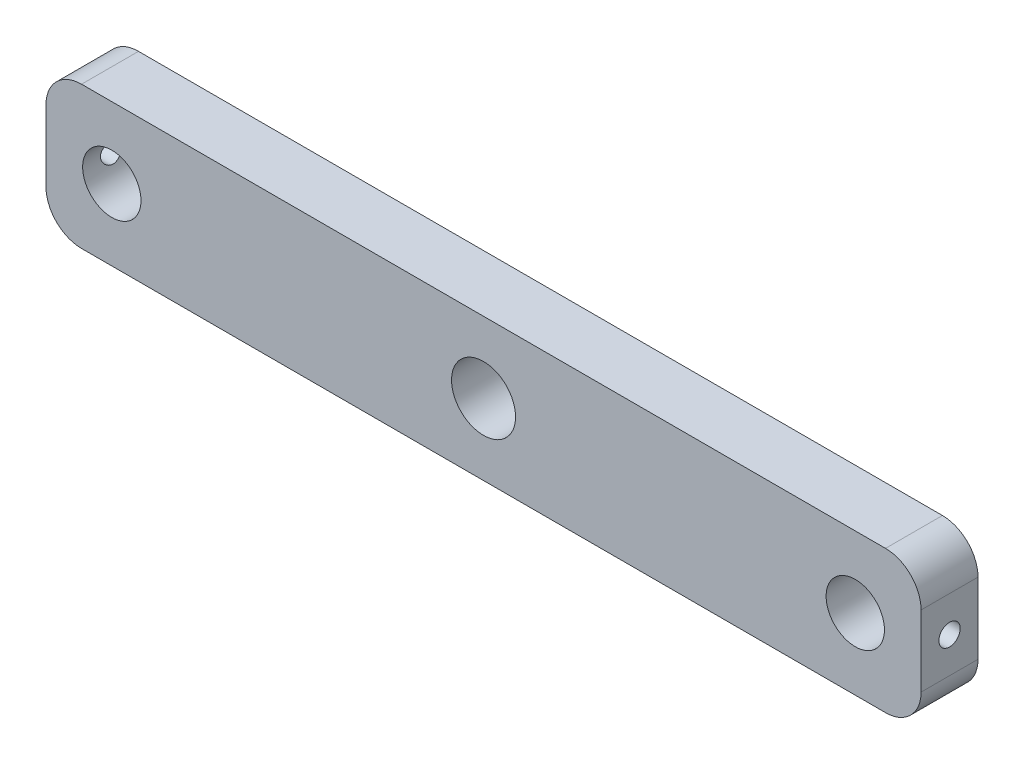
ISO-10303-21;
HEADER;
FILE_DESCRIPTION(('STEP AP214'),'2;1');
FILE_NAME('part.step','',(''),(''),'','','');
FILE_SCHEMA(('AUTOMOTIVE_DESIGN { 1 0 10303 214 1 1 1 1 }'));
ENDSEC;
DATA;
#1=APPLICATION_CONTEXT('core data for automotive mechanical design processes');
#2=APPLICATION_PROTOCOL_DEFINITION('international standard','automotive_design',2000,#1);
#3=PRODUCT_CONTEXT('',#1,'mechanical');
#4=PRODUCT('Part','Part','',(#3));
#5=PRODUCT_RELATED_PRODUCT_CATEGORY('part','',(#4));
#6=PRODUCT_DEFINITION_FORMATION('','',#4);
#7=PRODUCT_DEFINITION_CONTEXT('part definition',#1,'design');
#8=PRODUCT_DEFINITION('design','',#6,#7);
#9=PRODUCT_DEFINITION_SHAPE('','',#8);
#10=(LENGTH_UNIT() NAMED_UNIT(*) SI_UNIT(.MILLI.,.METRE.));
#11=(NAMED_UNIT(*) PLANE_ANGLE_UNIT() SI_UNIT($,.RADIAN.));
#12=(NAMED_UNIT(*) SI_UNIT($,.STERADIAN.) SOLID_ANGLE_UNIT());
#13=UNCERTAINTY_MEASURE_WITH_UNIT(LENGTH_MEASURE(1.E-05),#10,'distance_accuracy_value','');
#14=(GEOMETRIC_REPRESENTATION_CONTEXT(3) GLOBAL_UNCERTAINTY_ASSIGNED_CONTEXT((#13)) GLOBAL_UNIT_ASSIGNED_CONTEXT((#10,
#11,#12)) REPRESENTATION_CONTEXT('',''));
#15=CARTESIAN_POINT('',(0.,0.,0.));
#16=DIRECTION('',(0.,0.,1.));
#17=DIRECTION('',(1.,0.,0.));
#18=AXIS2_PLACEMENT_3D('',#15,#16,#17);
#19=CARTESIAN_POINT('',(0.,0.,8.));
#20=DIRECTION('',(0.,0.,1.));
#21=DIRECTION('',(1.,0.,0.));
#22=AXIS2_PLACEMENT_3D('',#19,#20,#21);
#23=PLANE('',#22);
#24=CARTESIAN_POINT('',(-61.5,9.99999999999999,8.));
#25=DIRECTION('',(0.,0.,1.));
#26=DIRECTION('',(1.,0.,0.));
#27=AXIS2_PLACEMENT_3D('',#24,#25,#26);
#28=CIRCLE('',#27,4.5);
#29=CARTESIAN_POINT('',(-57.,9.99999999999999,8.));
#30=VERTEX_POINT('',#29);
#31=EDGE_CURVE('E187',#30,#30,#28,.T.);
#32=ORIENTED_EDGE('',*,*,#31,.F.);
#33=EDGE_LOOP('',(#32));
#34=FACE_BOUND('',#33,.T.);
#35=DIRECTION('',(0.,1.,0.));
#36=VECTOR('',#35,1.);
#37=CARTESIAN_POINT('',(0.,0.,8.));
#38=LINE('',#37,#36);
#39=CARTESIAN_POINT('',(0.,5.,8.));
#40=VERTEX_POINT('',#39);
#41=CARTESIAN_POINT('',(0.,15.,8.));
#42=VERTEX_POINT('',#41);
#43=EDGE_CURVE('E130',#40,#42,#38,.T.);
#44=ORIENTED_EDGE('',*,*,#43,.T.);
#45=CARTESIAN_POINT('',(-5.,15.,8.));
#46=DIRECTION('',(0.,0.,1.));
#47=DIRECTION('',(1.,0.,0.));
#48=AXIS2_PLACEMENT_3D('',#45,#46,#47);
#49=CIRCLE('',#48,5.);
#50=CARTESIAN_POINT('',(-5.,20.,8.));
#51=VERTEX_POINT('',#50);
#52=EDGE_CURVE('E155',#42,#51,#49,.T.);
#53=ORIENTED_EDGE('',*,*,#52,.T.);
#54=DIRECTION('',(-1.,0.,0.));
#55=VECTOR('',#54,1.);
#56=CARTESIAN_POINT('',(0.,20.,8.));
#57=LINE('',#56,#55);
#58=CARTESIAN_POINT('',(-118.,20.,8.));
#59=VERTEX_POINT('',#58);
#60=EDGE_CURVE('E174',#51,#59,#57,.T.);
#61=ORIENTED_EDGE('',*,*,#60,.T.);
#62=CARTESIAN_POINT('',(-118.,15.,8.));
#63=DIRECTION('',(0.,0.,1.));
#64=DIRECTION('',(1.,0.,0.));
#65=AXIS2_PLACEMENT_3D('',#62,#63,#64);
#66=CIRCLE('',#65,5.);
#67=CARTESIAN_POINT('',(-123.,15.,8.));
#68=VERTEX_POINT('',#67);
#69=EDGE_CURVE('E137',#59,#68,#66,.T.);
#70=ORIENTED_EDGE('',*,*,#69,.T.);
#71=DIRECTION('',(0.,-1.,0.));
#72=VECTOR('',#71,1.);
#73=CARTESIAN_POINT('',(-123.,0.,8.));
#74=LINE('',#73,#72);
#75=CARTESIAN_POINT('',(-123.,4.99999999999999,8.));
#76=VERTEX_POINT('',#75);
#77=EDGE_CURVE('E120',#68,#76,#74,.T.);
#78=ORIENTED_EDGE('',*,*,#77,.T.);
#79=CARTESIAN_POINT('',(-118.,4.99999999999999,8.));
#80=DIRECTION('',(0.,0.,1.));
#81=DIRECTION('',(1.,0.,0.));
#82=AXIS2_PLACEMENT_3D('',#79,#80,#81);
#83=CIRCLE('',#82,5.);
#84=CARTESIAN_POINT('',(-118.,0.,8.));
#85=VERTEX_POINT('',#84);
#86=EDGE_CURVE('E58',#76,#85,#83,.T.);
#87=ORIENTED_EDGE('',*,*,#86,.T.);
#88=DIRECTION('',(1.,0.,0.));
#89=VECTOR('',#88,1.);
#90=CARTESIAN_POINT('',(0.,0.,8.));
#91=LINE('',#90,#89);
#92=CARTESIAN_POINT('',(-5.,0.,8.));
#93=VERTEX_POINT('',#92);
#94=EDGE_CURVE('E121',#85,#93,#91,.T.);
#95=ORIENTED_EDGE('',*,*,#94,.T.);
#96=CARTESIAN_POINT('',(-5.,5.,8.));
#97=DIRECTION('',(0.,0.,1.));
#98=DIRECTION('',(1.,0.,0.));
#99=AXIS2_PLACEMENT_3D('',#96,#97,#98);
#100=CIRCLE('',#99,5.);
#101=EDGE_CURVE('E153',#93,#40,#100,.T.);
#102=ORIENTED_EDGE('',*,*,#101,.T.);
#103=EDGE_LOOP('',(#44,#53,#61,#70,#78,#87,#95,#102));
#104=FACE_BOUND('',#103,.T.);
#105=CARTESIAN_POINT('',(-113.75,9.99999999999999,8.));
#106=DIRECTION('',(0.,0.,1.));
#107=DIRECTION('',(1.,0.,0.));
#108=AXIS2_PLACEMENT_3D('',#105,#106,#107);
#109=CIRCLE('',#108,4.09999999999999);
#110=CARTESIAN_POINT('',(-109.65,9.99999999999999,8.));
#111=VERTEX_POINT('',#110);
#112=EDGE_CURVE('E182',#111,#111,#109,.T.);
#113=ORIENTED_EDGE('',*,*,#112,.F.);
#114=EDGE_LOOP('',(#113));
#115=FACE_BOUND('',#114,.T.);
#116=CARTESIAN_POINT('',(-9.25,9.99999999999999,8.));
#117=DIRECTION('',(0.,0.,1.));
#118=DIRECTION('',(1.,0.,0.));
#119=AXIS2_PLACEMENT_3D('',#116,#117,#118);
#120=CIRCLE('',#119,4.1);
#121=CARTESIAN_POINT('',(-5.15,9.99999999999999,8.));
#122=VERTEX_POINT('',#121);
#123=EDGE_CURVE('E192',#122,#122,#120,.T.);
#124=ORIENTED_EDGE('',*,*,#123,.F.);
#125=EDGE_LOOP('',(#124));
#126=FACE_BOUND('',#125,.T.);
#127=ADVANCED_FACE('F37',(#34,#104,#115,#126),#23,.T.);
#128=CARTESIAN_POINT('',(0.,0.,0.));
#129=DIRECTION('',(0.,0.,1.));
#130=DIRECTION('',(1.,0.,0.));
#131=AXIS2_PLACEMENT_3D('',#128,#129,#130);
#132=PLANE('',#131);
#133=DIRECTION('',(-1.,0.,0.));
#134=VECTOR('',#133,1.);
#135=CARTESIAN_POINT('',(0.,20.,0.));
#136=LINE('',#135,#134);
#137=CARTESIAN_POINT('',(-5.,20.,0.));
#138=VERTEX_POINT('',#137);
#139=CARTESIAN_POINT('',(-118.,20.,0.));
#140=VERTEX_POINT('',#139);
#141=EDGE_CURVE('E128',#138,#140,#136,.T.);
#142=ORIENTED_EDGE('',*,*,#141,.F.);
#143=CARTESIAN_POINT('',(-5.,15.,0.));
#144=DIRECTION('',(0.,0.,1.));
#145=DIRECTION('',(1.,0.,0.));
#146=AXIS2_PLACEMENT_3D('',#143,#144,#145);
#147=CIRCLE('',#146,5.);
#148=CARTESIAN_POINT('',(0.,15.,0.));
#149=VERTEX_POINT('',#148);
#150=EDGE_CURVE('E145',#138,#149,#147,.F.);
#151=ORIENTED_EDGE('',*,*,#150,.T.);
#152=DIRECTION('',(0.,1.,0.));
#153=VECTOR('',#152,1.);
#154=CARTESIAN_POINT('',(0.,0.,0.));
#155=LINE('',#154,#153);
#156=CARTESIAN_POINT('',(0.,5.,0.));
#157=VERTEX_POINT('',#156);
#158=EDGE_CURVE('E132',#157,#149,#155,.T.);
#159=ORIENTED_EDGE('',*,*,#158,.F.);
#160=CARTESIAN_POINT('',(-5.,5.,0.));
#161=DIRECTION('',(0.,0.,1.));
#162=DIRECTION('',(1.,0.,0.));
#163=AXIS2_PLACEMENT_3D('',#160,#161,#162);
#164=CIRCLE('',#163,5.);
#165=CARTESIAN_POINT('',(-5.,0.,0.));
#166=VERTEX_POINT('',#165);
#167=EDGE_CURVE('E143',#157,#166,#164,.F.);
#168=ORIENTED_EDGE('',*,*,#167,.T.);
#169=DIRECTION('',(1.,0.,0.));
#170=VECTOR('',#169,1.);
#171=CARTESIAN_POINT('',(0.,0.,0.));
#172=LINE('',#171,#170);
#173=CARTESIAN_POINT('',(-118.,0.,0.));
#174=VERTEX_POINT('',#173);
#175=EDGE_CURVE('E127',#174,#166,#172,.T.);
#176=ORIENTED_EDGE('',*,*,#175,.F.);
#177=CARTESIAN_POINT('',(-118.,4.99999999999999,0.));
#178=DIRECTION('',(0.,0.,1.));
#179=DIRECTION('',(1.,0.,0.));
#180=AXIS2_PLACEMENT_3D('',#177,#178,#179);
#181=CIRCLE('',#180,5.);
#182=CARTESIAN_POINT('',(-123.,4.99999999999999,0.));
#183=VERTEX_POINT('',#182);
#184=EDGE_CURVE('E126',#174,#183,#181,.F.);
#185=ORIENTED_EDGE('',*,*,#184,.T.);
#186=DIRECTION('',(0.,-1.,0.));
#187=VECTOR('',#186,1.);
#188=CARTESIAN_POINT('',(-123.,0.,0.));
#189=LINE('',#188,#187);
#190=CARTESIAN_POINT('',(-123.,15.,0.));
#191=VERTEX_POINT('',#190);
#192=EDGE_CURVE('E118',#191,#183,#189,.T.);
#193=ORIENTED_EDGE('',*,*,#192,.F.);
#194=CARTESIAN_POINT('',(-118.,15.,0.));
#195=DIRECTION('',(0.,0.,1.));
#196=DIRECTION('',(1.,0.,0.));
#197=AXIS2_PLACEMENT_3D('',#194,#195,#196);
#198=CIRCLE('',#197,5.);
#199=EDGE_CURVE('E103',#191,#140,#198,.F.);
#200=ORIENTED_EDGE('',*,*,#199,.T.);
#201=EDGE_LOOP('',(#142,#151,#159,#168,#176,#185,#193,#200));
#202=FACE_BOUND('',#201,.T.);
#203=CARTESIAN_POINT('',(-113.75,9.99999999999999,0.));
#204=DIRECTION('',(0.,0.,1.));
#205=DIRECTION('',(1.,0.,0.));
#206=AXIS2_PLACEMENT_3D('',#203,#204,#205);
#207=CIRCLE('',#206,4.09999999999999);
#208=CARTESIAN_POINT('',(-109.65,9.99999999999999,0.));
#209=VERTEX_POINT('',#208);
#210=EDGE_CURVE('E178',#209,#209,#207,.T.);
#211=ORIENTED_EDGE('',*,*,#210,.T.);
#212=EDGE_LOOP('',(#211));
#213=FACE_BOUND('',#212,.T.);
#214=CARTESIAN_POINT('',(-61.5,9.99999999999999,0.));
#215=DIRECTION('',(0.,0.,1.));
#216=DIRECTION('',(1.,0.,0.));
#217=AXIS2_PLACEMENT_3D('',#214,#215,#216);
#218=CIRCLE('',#217,4.5);
#219=CARTESIAN_POINT('',(-57.,9.99999999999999,0.));
#220=VERTEX_POINT('',#219);
#221=EDGE_CURVE('E189',#220,#220,#218,.T.);
#222=ORIENTED_EDGE('',*,*,#221,.T.);
#223=EDGE_LOOP('',(#222));
#224=FACE_BOUND('',#223,.T.);
#225=CARTESIAN_POINT('',(-9.25,9.99999999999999,0.));
#226=DIRECTION('',(0.,0.,1.));
#227=DIRECTION('',(1.,0.,0.));
#228=AXIS2_PLACEMENT_3D('',#225,#226,#227);
#229=CIRCLE('',#228,4.1);
#230=CARTESIAN_POINT('',(-5.15,9.99999999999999,0.));
#231=VERTEX_POINT('',#230);
#232=EDGE_CURVE('E195',#231,#231,#229,.T.);
#233=ORIENTED_EDGE('',*,*,#232,.T.);
#234=EDGE_LOOP('',(#233));
#235=FACE_BOUND('',#234,.T.);
#236=ADVANCED_FACE('F123',(#202,#213,#224,#235),#132,.F.);
#237=CARTESIAN_POINT('',(0.,0.,8.));
#238=DIRECTION('',(-1.,0.,0.));
#239=DIRECTION('',(0.,0.,1.));
#240=AXIS2_PLACEMENT_3D('',#237,#238,#239);
#241=PLANE('',#240);
#242=CARTESIAN_POINT('',(0.,10.,4.));
#243=DIRECTION('',(1.,0.,0.));
#244=DIRECTION('',(0.,0.,-1.));
#245=AXIS2_PLACEMENT_3D('',#242,#243,#244);
#246=CIRCLE('',#245,1.5);
#247=CARTESIAN_POINT('',(0.,10.,2.5));
#248=VERTEX_POINT('',#247);
#249=EDGE_CURVE('E212',#248,#248,#246,.T.);
#250=ORIENTED_EDGE('',*,*,#249,.F.);
#251=EDGE_LOOP('',(#250));
#252=FACE_BOUND('',#251,.T.);
#253=ORIENTED_EDGE('',*,*,#158,.T.);
#254=DIRECTION('',(0.,0.,-1.));
#255=VECTOR('',#254,1.);
#256=CARTESIAN_POINT('',(0.,15.,8.));
#257=LINE('',#256,#255);
#258=EDGE_CURVE('E150',#149,#42,#257,.F.);
#259=ORIENTED_EDGE('',*,*,#258,.T.);
#260=ORIENTED_EDGE('',*,*,#43,.F.);
#261=DIRECTION('',(0.,0.,-1.));
#262=VECTOR('',#261,1.);
#263=CARTESIAN_POINT('',(0.,5.,8.));
#264=LINE('',#263,#262);
#265=EDGE_CURVE('E147',#40,#157,#264,.T.);
#266=ORIENTED_EDGE('',*,*,#265,.T.);
#267=EDGE_LOOP('',(#253,#259,#260,#266));
#268=FACE_BOUND('',#267,.T.);
#269=ADVANCED_FACE('F170',(#252,#268),#241,.F.);
#270=CARTESIAN_POINT('',(0.,20.,8.));
#271=DIRECTION('',(0.,-1.,0.));
#272=DIRECTION('',(1.,0.,0.));
#273=AXIS2_PLACEMENT_3D('',#270,#271,#272);
#274=PLANE('',#273);
#275=ORIENTED_EDGE('',*,*,#60,.F.);
#276=DIRECTION('',(0.,0.,-1.));
#277=VECTOR('',#276,1.);
#278=CARTESIAN_POINT('',(-5.,20.,8.));
#279=LINE('',#278,#277);
#280=EDGE_CURVE('E139',#51,#138,#279,.T.);
#281=ORIENTED_EDGE('',*,*,#280,.T.);
#282=ORIENTED_EDGE('',*,*,#141,.T.);
#283=DIRECTION('',(0.,0.,-1.));
#284=VECTOR('',#283,1.);
#285=CARTESIAN_POINT('',(-118.,20.,8.));
#286=LINE('',#285,#284);
#287=EDGE_CURVE('E109',#140,#59,#286,.F.);
#288=ORIENTED_EDGE('',*,*,#287,.T.);
#289=EDGE_LOOP('',(#275,#281,#282,#288));
#290=FACE_BOUND('',#289,.T.);
#291=ADVANCED_FACE('F234',(#290),#274,.F.);
#292=CARTESIAN_POINT('',(-123.,0.,8.));
#293=DIRECTION('',(1.,0.,0.));
#294=DIRECTION('',(0.,0.,-1.));
#295=AXIS2_PLACEMENT_3D('',#292,#293,#294);
#296=PLANE('',#295);
#297=CARTESIAN_POINT('',(-123.,9.99999999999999,4.));
#298=DIRECTION('',(-1.,0.,0.));
#299=DIRECTION('',(0.,0.,1.));
#300=AXIS2_PLACEMENT_3D('',#297,#298,#299);
#301=CIRCLE('',#300,1.5);
#302=CARTESIAN_POINT('',(-123.,9.99999999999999,5.5));
#303=VERTEX_POINT('',#302);
#304=EDGE_CURVE('E198',#303,#303,#301,.T.);
#305=ORIENTED_EDGE('',*,*,#304,.F.);
#306=EDGE_LOOP('',(#305));
#307=FACE_BOUND('',#306,.T.);
#308=ORIENTED_EDGE('',*,*,#192,.T.);
#309=DIRECTION('',(0.,0.,-1.));
#310=VECTOR('',#309,1.);
#311=CARTESIAN_POINT('',(-123.,4.99999999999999,8.));
#312=LINE('',#311,#310);
#313=EDGE_CURVE('E11',#183,#76,#312,.F.);
#314=ORIENTED_EDGE('',*,*,#313,.T.);
#315=ORIENTED_EDGE('',*,*,#77,.F.);
#316=DIRECTION('',(0.,0.,-1.));
#317=VECTOR('',#316,1.);
#318=CARTESIAN_POINT('',(-123.,15.,8.));
#319=LINE('',#318,#317);
#320=EDGE_CURVE('E107',#68,#191,#319,.T.);
#321=ORIENTED_EDGE('',*,*,#320,.T.);
#322=EDGE_LOOP('',(#308,#314,#315,#321));
#323=FACE_BOUND('',#322,.T.);
#324=ADVANCED_FACE('F117',(#307,#323),#296,.F.);
#325=CARTESIAN_POINT('',(0.,0.,8.));
#326=DIRECTION('',(0.,1.,0.));
#327=DIRECTION('',(-1.,0.,0.));
#328=AXIS2_PLACEMENT_3D('',#325,#326,#327);
#329=PLANE('',#328);
#330=ORIENTED_EDGE('',*,*,#175,.T.);
#331=DIRECTION('',(0.,0.,-1.));
#332=VECTOR('',#331,1.);
#333=CARTESIAN_POINT('',(-5.,0.,8.));
#334=LINE('',#333,#332);
#335=EDGE_CURVE('E45',#166,#93,#334,.F.);
#336=ORIENTED_EDGE('',*,*,#335,.T.);
#337=ORIENTED_EDGE('',*,*,#94,.F.);
#338=DIRECTION('',(0.,0.,-1.));
#339=VECTOR('',#338,1.);
#340=CARTESIAN_POINT('',(-118.,0.,8.));
#341=LINE('',#340,#339);
#342=EDGE_CURVE('E157',#85,#174,#341,.T.);
#343=ORIENTED_EDGE('',*,*,#342,.T.);
#344=EDGE_LOOP('',(#330,#336,#337,#343));
#345=FACE_BOUND('',#344,.T.);
#346=ADVANCED_FACE('F160',(#345),#329,.F.);
#347=CARTESIAN_POINT('',(-113.75,9.99999999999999,8.));
#348=DIRECTION('',(0.,0.,-1.));
#349=DIRECTION('',(-1.,0.,0.));
#350=AXIS2_PLACEMENT_3D('',#347,#348,#349);
#351=CYLINDRICAL_SURFACE('',#350,4.09999999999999);
#352=CARTESIAN_POINT('',(-117.85,9.99999999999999,5.5));
#353=CARTESIAN_POINT('',(-117.850001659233,10.0813740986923,5.50000225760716));
#354=CARTESIAN_POINT('',(-117.847556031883,10.1627323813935,5.49335733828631));
#355=CARTESIAN_POINT('',(-117.838043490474,10.3230252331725,5.46705471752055));
#356=CARTESIAN_POINT('',(-117.830976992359,10.4019600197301,5.44739818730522));
#357=CARTESIAN_POINT('',(-117.812983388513,10.5550714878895,5.39585535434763));
#358=CARTESIAN_POINT('',(-117.802063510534,10.6292567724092,5.36399193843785));
#359=CARTESIAN_POINT('',(-117.777456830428,10.7712256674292,5.28905328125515));
#360=CARTESIAN_POINT('',(-117.763769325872,10.8390076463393,5.24597519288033));
#361=CARTESIAN_POINT('',(-117.734423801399,10.9690058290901,5.14799554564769));
#362=CARTESIAN_POINT('',(-117.718711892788,11.0309264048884,5.09271802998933));
#363=CARTESIAN_POINT('',(-117.687360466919,11.1448538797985,4.97270690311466));
#364=CARTESIAN_POINT('',(-117.67172097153,11.196857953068,4.9079706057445));
#365=CARTESIAN_POINT('',(-117.641666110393,11.2913112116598,4.76804336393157));
#366=CARTESIAN_POINT('',(-117.627314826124,11.333350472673,4.69256058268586));
#367=CARTESIAN_POINT('',(-117.602295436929,11.4040068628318,4.53498771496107));
#368=CARTESIAN_POINT('',(-117.591625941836,11.4326290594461,4.45290013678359));
#369=CARTESIAN_POINT('',(-117.575752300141,11.4744848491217,4.28784309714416));
#370=CARTESIAN_POINT('',(-117.570349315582,11.4882805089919,4.20503591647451));
#371=CARTESIAN_POINT('',(-117.565037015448,11.5018491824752,4.03811924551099));
#372=CARTESIAN_POINT('',(-117.565125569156,11.5016276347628,3.95401027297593));
#373=CARTESIAN_POINT('',(-117.570614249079,11.4875994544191,3.79193635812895));
#374=CARTESIAN_POINT('',(-117.575713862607,11.4745614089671,3.71389285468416));
#375=CARTESIAN_POINT('',(-117.590152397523,11.4365370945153,3.56118956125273));
#376=CARTESIAN_POINT('',(-117.599491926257,11.4115491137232,3.48653025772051));
#377=CARTESIAN_POINT('',(-117.621546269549,11.3498942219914,3.34110766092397));
#378=CARTESIAN_POINT('',(-117.634319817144,11.3130216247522,3.27044087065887));
#379=CARTESIAN_POINT('',(-117.661782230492,11.2287873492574,3.13607014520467));
#380=CARTESIAN_POINT('',(-117.676471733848,11.1814221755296,3.07236854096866));
#381=CARTESIAN_POINT('',(-117.707253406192,11.0739910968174,2.94946662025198));
#382=CARTESIAN_POINT('',(-117.723375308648,11.0133081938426,2.89081180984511));
#383=CARTESIAN_POINT('',(-117.754397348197,10.8827781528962,2.7843534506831));
#384=CARTESIAN_POINT('',(-117.769297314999,10.8129297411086,2.73655141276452));
#385=CARTESIAN_POINT('',(-117.796467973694,10.6647140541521,2.65259238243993));
#386=CARTESIAN_POINT('',(-117.808698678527,10.5862406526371,2.61660888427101));
#387=CARTESIAN_POINT('',(-117.82885780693,10.4237962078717,2.55853261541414));
#388=CARTESIAN_POINT('',(-117.836788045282,10.3398275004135,2.536433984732));
#389=CARTESIAN_POINT('',(-117.847137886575,10.1733733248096,2.50778451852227));
#390=CARTESIAN_POINT('',(-117.849817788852,10.0910304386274,2.50049855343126));
#391=CARTESIAN_POINT('',(-117.850163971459,9.92626501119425,2.49955130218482));
#392=CARTESIAN_POINT('',(-117.847831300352,9.84384249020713,2.50588716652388));
#393=CARTESIAN_POINT('',(-117.838586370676,9.68438031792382,2.5314392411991));
#394=CARTESIAN_POINT('',(-117.831842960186,9.60725381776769,2.55018085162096));
#395=CARTESIAN_POINT('',(-117.814623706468,9.45728861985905,2.59939476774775));
#396=CARTESIAN_POINT('',(-117.804147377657,9.38445048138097,2.6298685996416));
#397=CARTESIAN_POINT('',(-117.7801281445,9.24278090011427,2.70263978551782));
#398=CARTESIAN_POINT('',(-117.76650558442,9.17412535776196,2.74525249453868));
#399=CARTESIAN_POINT('',(-117.737710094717,9.04471452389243,2.8407324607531));
#400=CARTESIAN_POINT('',(-117.722536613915,8.98396205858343,2.8936033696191));
#401=CARTESIAN_POINT('',(-117.691276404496,8.86858034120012,3.01153499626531));
#402=CARTESIAN_POINT('',(-117.675185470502,8.81447372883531,3.07710725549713));
#403=CARTESIAN_POINT('',(-117.644725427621,8.71793766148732,3.21672556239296));
#404=CARTESIAN_POINT('',(-117.630356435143,8.67550899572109,3.29077218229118));
#405=CARTESIAN_POINT('',(-117.605050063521,8.60355617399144,3.44569559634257));
#406=CARTESIAN_POINT('',(-117.59412129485,8.57406432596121,3.52658889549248));
#407=CARTESIAN_POINT('',(-117.577222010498,8.52930109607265,3.69270108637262));
#408=CARTESIAN_POINT('',(-117.571248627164,8.51402148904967,3.77791744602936));
#409=CARTESIAN_POINT('',(-117.56530529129,8.49883191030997,3.94462468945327));
#410=CARTESIAN_POINT('',(-117.564989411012,8.498036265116,4.02602326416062));
#411=CARTESIAN_POINT('',(-117.569517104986,8.50958838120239,4.18772832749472));
#412=CARTESIAN_POINT('',(-117.574360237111,8.52193501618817,4.26803490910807));
#413=CARTESIAN_POINT('',(-117.58837884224,8.5587447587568,4.42303247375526));
#414=CARTESIAN_POINT('',(-117.59743089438,8.58286360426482,4.49781731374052));
#415=CARTESIAN_POINT('',(-117.618781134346,8.64223605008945,4.64232656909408));
#416=CARTESIAN_POINT('',(-117.631080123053,8.67749239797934,4.71204973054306));
#417=CARTESIAN_POINT('',(-117.658312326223,8.76020994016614,4.8482855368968));
#418=CARTESIAN_POINT('',(-117.673347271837,8.80819799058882,4.91445773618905));
#419=CARTESIAN_POINT('',(-117.703990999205,8.9141844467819,5.03809398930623));
#420=CARTESIAN_POINT('',(-117.719599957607,8.97218595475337,5.09555533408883));
#421=CARTESIAN_POINT('',(-117.75057969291,9.10005731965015,5.20309003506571));
#422=CARTESIAN_POINT('',(-117.765898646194,9.17037857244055,5.25264383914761));
#423=CARTESIAN_POINT('',(-117.793733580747,9.31888373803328,5.33920330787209));
#424=CARTESIAN_POINT('',(-117.806249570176,9.39706762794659,5.37620900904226));
#425=CARTESIAN_POINT('',(-117.827288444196,9.56102911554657,5.43705267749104));
#426=CARTESIAN_POINT('',(-117.835712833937,9.64694003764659,5.46056810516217));
#427=CARTESIAN_POINT('',(-117.84706649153,9.82190788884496,5.49203709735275));
#428=CARTESIAN_POINT('',(-117.849998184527,9.91096341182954,5.49999752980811));
#429=CARTESIAN_POINT('',(-117.85,9.99999999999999,5.5));
#430=B_SPLINE_CURVE_WITH_KNOTS('',3,(#352,#353,#354,#355,#356,#357,#358,#359,#360,#361,#362,
#363,#364,#365,#366,#367,#368,#369,#370,#371,#372,#373,#374,#375,#376,#377,#378,#379,#380,#381,
#382,#383,#384,#385,#386,#387,#388,#389,#390,#391,#392,#393,#394,#395,#396,#397,#398,#399,#400,
#401,#402,#403,#404,#405,#406,#407,#408,#409,#410,#411,#412,#413,#414,#415,#416,#417,#418,#419,
#420,#421,#422,#423,#424,#425,#426,#427,#428,#429),.UNSPECIFIED.,.T.,.F.,(4,2,2,2,2,2,2,2,2,2,2,
2,2,2,2,2,2,2,2,2,2,2,2,2,2,2,2,2,2,2,2,2,2,2,2,2,2,2,4),(0.,0.243794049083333,
0.487566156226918,0.730883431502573,0.974262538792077,1.22657525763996,1.47895976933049,
1.74040261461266,2.00174663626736,2.25278996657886,2.50373589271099,2.74049742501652,
2.97729288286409,3.21842895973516,3.45964548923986,3.71623310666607,3.97285642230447,
4.23309408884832,4.49322185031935,4.74008954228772,4.9869055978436,5.22478638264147,
5.46269812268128,5.70746441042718,5.95231798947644,6.21067838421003,6.46905623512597,
6.72807572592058,6.98694521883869,7.22992815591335,7.47289027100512,7.70913823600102,
7.94544452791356,8.19369587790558,8.44202427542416,8.7028917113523,8.96375838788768,
9.23062685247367,9.49737746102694),.UNSPECIFIED.);
#431=CARTESIAN_POINT('',(-117.85,9.99999999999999,5.5));
#432=VERTEX_POINT('',#431);
#433=EDGE_CURVE('E203',#432,#432,#430,.T.);
#434=ORIENTED_EDGE('',*,*,#433,.T.);
#435=EDGE_LOOP('',(#434));
#436=FACE_BOUND('',#435,.T.);
#437=ORIENTED_EDGE('',*,*,#112,.T.);
#438=EDGE_LOOP('',(#437));
#439=FACE_BOUND('',#438,.T.);
#440=ORIENTED_EDGE('',*,*,#210,.F.);
#441=EDGE_LOOP('',(#440));
#442=FACE_BOUND('',#441,.T.);
#443=ADVANCED_FACE('F251',(#436,#439,#442),#351,.F.);
#444=CARTESIAN_POINT('',(-61.5,9.99999999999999,8.));
#445=DIRECTION('',(0.,0.,-1.));
#446=DIRECTION('',(-1.,0.,0.));
#447=AXIS2_PLACEMENT_3D('',#444,#445,#446);
#448=CYLINDRICAL_SURFACE('',#447,4.5);
#449=ORIENTED_EDGE('',*,*,#31,.T.);
#450=EDGE_LOOP('',(#449));
#451=FACE_BOUND('',#450,.T.);
#452=ORIENTED_EDGE('',*,*,#221,.F.);
#453=EDGE_LOOP('',(#452));
#454=FACE_BOUND('',#453,.T.);
#455=ADVANCED_FACE('F272',(#451,#454),#448,.F.);
#456=CARTESIAN_POINT('',(-9.25,9.99999999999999,8.));
#457=DIRECTION('',(0.,0.,-1.));
#458=DIRECTION('',(-1.,0.,0.));
#459=AXIS2_PLACEMENT_3D('',#456,#457,#458);
#460=CYLINDRICAL_SURFACE('',#459,4.1);
#461=CARTESIAN_POINT('',(-5.15,10.,2.5));
#462=CARTESIAN_POINT('',(-5.14999834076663,10.0813740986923,2.49999774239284));
#463=CARTESIAN_POINT('',(-5.15244396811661,10.1627323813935,2.50664266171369));
#464=CARTESIAN_POINT('',(-5.1619565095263,10.3230252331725,2.53294528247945));
#465=CARTESIAN_POINT('',(-5.16902300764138,10.4019600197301,2.55260181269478));
#466=CARTESIAN_POINT('',(-5.1870166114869,10.5550714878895,2.60414464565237));
#467=CARTESIAN_POINT('',(-5.19793648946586,10.6292567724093,2.63600806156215));
#468=CARTESIAN_POINT('',(-5.22254316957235,10.7712256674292,2.71094671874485));
#469=CARTESIAN_POINT('',(-5.23623067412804,10.8390076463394,2.75402480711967));
#470=CARTESIAN_POINT('',(-5.2655761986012,10.9690058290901,2.85200445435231));
#471=CARTESIAN_POINT('',(-5.28128810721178,11.0309264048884,2.90728197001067));
#472=CARTESIAN_POINT('',(-5.31263953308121,11.1448538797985,3.02729309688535));
#473=CARTESIAN_POINT('',(-5.3282790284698,11.196857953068,3.0920293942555));
#474=CARTESIAN_POINT('',(-5.35833388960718,11.2913112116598,3.23195663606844));
#475=CARTESIAN_POINT('',(-5.37268517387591,11.333350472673,3.30743941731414));
#476=CARTESIAN_POINT('',(-5.39770456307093,11.4040068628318,3.46501228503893));
#477=CARTESIAN_POINT('',(-5.4083740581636,11.4326290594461,3.54709986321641));
#478=CARTESIAN_POINT('',(-5.42424769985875,11.4744848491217,3.71215690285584));
#479=CARTESIAN_POINT('',(-5.42965068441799,11.4882805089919,3.79496408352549));
#480=CARTESIAN_POINT('',(-5.4349629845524,11.5018491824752,3.96188075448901));
#481=CARTESIAN_POINT('',(-5.4348744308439,11.5016276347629,4.04598972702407));
#482=CARTESIAN_POINT('',(-5.42938575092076,11.4875994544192,4.20806364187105));
#483=CARTESIAN_POINT('',(-5.42428613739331,11.4745614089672,4.28610714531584));
#484=CARTESIAN_POINT('',(-5.40984760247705,11.4365370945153,4.43881043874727));
#485=CARTESIAN_POINT('',(-5.40050807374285,11.4115491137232,4.51346974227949));
#486=CARTESIAN_POINT('',(-5.37845373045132,11.3498942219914,4.65889233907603));
#487=CARTESIAN_POINT('',(-5.36568018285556,11.3130216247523,4.72955912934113));
#488=CARTESIAN_POINT('',(-5.33821776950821,11.2287873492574,4.86392985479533));
#489=CARTESIAN_POINT('',(-5.32352826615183,11.1814221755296,4.92763145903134));
#490=CARTESIAN_POINT('',(-5.29274659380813,11.0739910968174,5.05053337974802));
#491=CARTESIAN_POINT('',(-5.27662469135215,11.0133081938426,5.10918819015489));
#492=CARTESIAN_POINT('',(-5.24560265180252,10.8827781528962,5.2156465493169));
#493=CARTESIAN_POINT('',(-5.23070268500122,10.8129297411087,5.26344858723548));
#494=CARTESIAN_POINT('',(-5.20353202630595,10.6647140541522,5.34740761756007));
#495=CARTESIAN_POINT('',(-5.19130132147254,10.5862406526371,5.38339111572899));
#496=CARTESIAN_POINT('',(-5.17114219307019,10.4237962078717,5.44146738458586));
#497=CARTESIAN_POINT('',(-5.16321195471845,10.3398275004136,5.463566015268));
#498=CARTESIAN_POINT('',(-5.15286211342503,10.1733733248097,5.49221548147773));
#499=CARTESIAN_POINT('',(-5.15018221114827,10.0910304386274,5.49950144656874));
#500=CARTESIAN_POINT('',(-5.14983602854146,9.92626501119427,5.50044869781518));
#501=CARTESIAN_POINT('',(-5.15216869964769,9.84384249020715,5.49411283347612));
#502=CARTESIAN_POINT('',(-5.16141362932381,9.68438031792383,5.4685607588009));
#503=CARTESIAN_POINT('',(-5.16815703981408,9.60725381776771,5.44981914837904));
#504=CARTESIAN_POINT('',(-5.18537629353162,9.45728861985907,5.40060523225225));
#505=CARTESIAN_POINT('',(-5.19585262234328,9.38445048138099,5.37013140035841));
#506=CARTESIAN_POINT('',(-5.21987185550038,9.24278090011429,5.29736021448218));
#507=CARTESIAN_POINT('',(-5.23349441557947,9.17412535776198,5.25474750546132));
#508=CARTESIAN_POINT('',(-5.26228990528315,9.04471452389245,5.1592675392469));
#509=CARTESIAN_POINT('',(-5.27746338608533,8.98396205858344,5.1063966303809));
#510=CARTESIAN_POINT('',(-5.30872359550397,8.86858034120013,4.98846500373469));
#511=CARTESIAN_POINT('',(-5.32481452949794,8.81447372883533,4.92289274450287));
#512=CARTESIAN_POINT('',(-5.3552745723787,8.71793766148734,4.78327443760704));
#513=CARTESIAN_POINT('',(-5.3696435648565,8.67550899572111,4.70922781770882));
#514=CARTESIAN_POINT('',(-5.39494993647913,8.60355617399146,4.55430440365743));
#515=CARTESIAN_POINT('',(-5.4058787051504,8.57406432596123,4.47341110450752));
#516=CARTESIAN_POINT('',(-5.42277798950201,8.52930109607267,4.30729891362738));
#517=CARTESIAN_POINT('',(-5.42875137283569,8.51402148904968,4.22208255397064));
#518=CARTESIAN_POINT('',(-5.43469470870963,8.49883191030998,4.05537531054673));
#519=CARTESIAN_POINT('',(-5.43501058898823,8.49803626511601,3.97397673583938));
#520=CARTESIAN_POINT('',(-5.43048289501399,8.5095883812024,3.81227167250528));
#521=CARTESIAN_POINT('',(-5.42563976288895,8.52193501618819,3.73196509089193));
#522=CARTESIAN_POINT('',(-5.41162115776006,8.55874475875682,3.57696752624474));
#523=CARTESIAN_POINT('',(-5.40256910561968,8.58286360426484,3.50218268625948));
#524=CARTESIAN_POINT('',(-5.3812188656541,8.64223605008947,3.35767343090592));
#525=CARTESIAN_POINT('',(-5.36891987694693,8.67749239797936,3.28795026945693));
#526=CARTESIAN_POINT('',(-5.34168767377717,8.76020994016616,3.1517144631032));
#527=CARTESIAN_POINT('',(-5.32665272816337,8.80819799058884,3.08554226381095));
#528=CARTESIAN_POINT('',(-5.29600900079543,8.91418444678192,2.96190601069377));
#529=CARTESIAN_POINT('',(-5.28040004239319,8.97218595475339,2.90444466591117));
#530=CARTESIAN_POINT('',(-5.24942030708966,9.10005731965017,2.79690996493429));
#531=CARTESIAN_POINT('',(-5.23410135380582,9.17037857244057,2.74735616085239));
#532=CARTESIAN_POINT('',(-5.20626641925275,9.3188837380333,2.6607966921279));
#533=CARTESIAN_POINT('',(-5.1937504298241,9.39706762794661,2.62379099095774));
#534=CARTESIAN_POINT('',(-5.1727115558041,9.56102911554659,2.56294732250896));
#535=CARTESIAN_POINT('',(-5.16428716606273,9.64694003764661,2.53943189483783));
#536=CARTESIAN_POINT('',(-5.1529335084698,9.82190788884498,2.50796290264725));
#537=CARTESIAN_POINT('',(-5.15000181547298,9.91096341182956,2.50000247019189));
#538=CARTESIAN_POINT('',(-5.15,10.,2.5));
#539=B_SPLINE_CURVE_WITH_KNOTS('',3,(#461,#462,#463,#464,#465,#466,#467,#468,#469,#470,#471,
#472,#473,#474,#475,#476,#477,#478,#479,#480,#481,#482,#483,#484,#485,#486,#487,#488,#489,#490,
#491,#492,#493,#494,#495,#496,#497,#498,#499,#500,#501,#502,#503,#504,#505,#506,#507,#508,#509,
#510,#511,#512,#513,#514,#515,#516,#517,#518,#519,#520,#521,#522,#523,#524,#525,#526,#527,#528,
#529,#530,#531,#532,#533,#534,#535,#536,#537,#538),.UNSPECIFIED.,.T.,.F.,(4,2,2,2,2,2,2,2,2,2,2,
2,2,2,2,2,2,2,2,2,2,2,2,2,2,2,2,2,2,2,2,2,2,2,2,2,2,2,4),(0.,0.243794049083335,
0.487566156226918,0.730883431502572,0.974262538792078,1.22657525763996,1.4789597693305,
1.74040261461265,2.00174663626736,2.25278996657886,2.50373589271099,2.74049742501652,
2.97729288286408,3.21842895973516,3.45964548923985,3.71623310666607,3.97285642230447,
4.23309408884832,4.49322185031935,4.74008954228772,4.9869055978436,5.22478638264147,
5.46269812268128,5.70746441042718,5.95231798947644,6.21067838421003,6.46905623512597,
6.72807572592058,6.98694521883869,7.22992815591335,7.47289027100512,7.70913823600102,
7.94544452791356,8.19369587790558,8.44202427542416,8.7028917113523,8.96375838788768,
9.23062685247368,9.49737746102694),.UNSPECIFIED.);
#540=CARTESIAN_POINT('',(-5.15,10.,2.5));
#541=VERTEX_POINT('',#540);
#542=EDGE_CURVE('E211',#541,#541,#539,.T.);
#543=ORIENTED_EDGE('',*,*,#542,.T.);
#544=EDGE_LOOP('',(#543));
#545=FACE_BOUND('',#544,.T.);
#546=ORIENTED_EDGE('',*,*,#123,.T.);
#547=EDGE_LOOP('',(#546));
#548=FACE_BOUND('',#547,.T.);
#549=ORIENTED_EDGE('',*,*,#232,.F.);
#550=EDGE_LOOP('',(#549));
#551=FACE_BOUND('',#550,.T.);
#552=ADVANCED_FACE('F280',(#545,#548,#551),#460,.F.);
#553=CARTESIAN_POINT('',(-118.,15.,8.));
#554=DIRECTION('',(0.,0.,-1.));
#555=DIRECTION('',(-1.,0.,0.));
#556=AXIS2_PLACEMENT_3D('',#553,#554,#555);
#557=CYLINDRICAL_SURFACE('',#556,5.);
#558=ORIENTED_EDGE('',*,*,#69,.F.);
#559=ORIENTED_EDGE('',*,*,#287,.F.);
#560=ORIENTED_EDGE('',*,*,#199,.F.);
#561=ORIENTED_EDGE('',*,*,#320,.F.);
#562=EDGE_LOOP('',(#558,#559,#560,#561));
#563=FACE_BOUND('',#562,.T.);
#564=ADVANCED_FACE('F106',(#563),#557,.T.);
#565=CARTESIAN_POINT('',(-5.,15.,8.));
#566=DIRECTION('',(0.,0.,-1.));
#567=DIRECTION('',(-1.,0.,0.));
#568=AXIS2_PLACEMENT_3D('',#565,#566,#567);
#569=CYLINDRICAL_SURFACE('',#568,5.);
#570=ORIENTED_EDGE('',*,*,#52,.F.);
#571=ORIENTED_EDGE('',*,*,#258,.F.);
#572=ORIENTED_EDGE('',*,*,#150,.F.);
#573=ORIENTED_EDGE('',*,*,#280,.F.);
#574=EDGE_LOOP('',(#570,#571,#572,#573));
#575=FACE_BOUND('',#574,.T.);
#576=ADVANCED_FACE('F286',(#575),#569,.T.);
#577=CARTESIAN_POINT('',(-5.,5.,8.));
#578=DIRECTION('',(0.,0.,-1.));
#579=DIRECTION('',(-1.,0.,0.));
#580=AXIS2_PLACEMENT_3D('',#577,#578,#579);
#581=CYLINDRICAL_SURFACE('',#580,5.);
#582=ORIENTED_EDGE('',*,*,#101,.F.);
#583=ORIENTED_EDGE('',*,*,#335,.F.);
#584=ORIENTED_EDGE('',*,*,#167,.F.);
#585=ORIENTED_EDGE('',*,*,#265,.F.);
#586=EDGE_LOOP('',(#582,#583,#584,#585));
#587=FACE_BOUND('',#586,.T.);
#588=ADVANCED_FACE('F167',(#587),#581,.T.);
#589=CARTESIAN_POINT('',(-118.,4.99999999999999,8.));
#590=DIRECTION('',(0.,0.,-1.));
#591=DIRECTION('',(-1.,0.,0.));
#592=AXIS2_PLACEMENT_3D('',#589,#590,#591);
#593=CYLINDRICAL_SURFACE('',#592,5.);
#594=ORIENTED_EDGE('',*,*,#86,.F.);
#595=ORIENTED_EDGE('',*,*,#313,.F.);
#596=ORIENTED_EDGE('',*,*,#184,.F.);
#597=ORIENTED_EDGE('',*,*,#342,.F.);
#598=EDGE_LOOP('',(#594,#595,#596,#597));
#599=FACE_BOUND('',#598,.T.);
#600=ADVANCED_FACE('F39',(#599),#593,.T.);
#601=CARTESIAN_POINT('',(0.001000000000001,9.99999999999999,4.));
#602=DIRECTION('',(-1.,0.,0.));
#603=DIRECTION('',(0.,0.,1.));
#604=AXIS2_PLACEMENT_3D('',#601,#602,#603);
#605=CYLINDRICAL_SURFACE('',#604,1.5);
#606=ORIENTED_EDGE('',*,*,#433,.F.);
#607=EDGE_LOOP('',(#606));
#608=FACE_BOUND('',#607,.T.);
#609=ORIENTED_EDGE('',*,*,#304,.T.);
#610=EDGE_LOOP('',(#609));
#611=FACE_BOUND('',#610,.T.);
#612=ADVANCED_FACE('F214',(#608,#611),#605,.F.);
#613=CARTESIAN_POINT('',(-123.001,10.,4.));
#614=DIRECTION('',(1.,0.,0.));
#615=DIRECTION('',(0.,0.,-1.));
#616=AXIS2_PLACEMENT_3D('',#613,#614,#615);
#617=CYLINDRICAL_SURFACE('',#616,1.5);
#618=ORIENTED_EDGE('',*,*,#542,.F.);
#619=EDGE_LOOP('',(#618));
#620=FACE_BOUND('',#619,.T.);
#621=ORIENTED_EDGE('',*,*,#249,.T.);
#622=EDGE_LOOP('',(#621));
#623=FACE_BOUND('',#622,.T.);
#624=ADVANCED_FACE('F221',(#620,#623),#617,.F.);
#625=CLOSED_SHELL('',(#127,#236,#269,#291,#324,#346,#443,#455,#552,#564,#576,#588,#600,#612,#624));
#626=MANIFOLD_SOLID_BREP('B2',#625);
#627=ADVANCED_BREP_SHAPE_REPRESENTATION('',(#18,#626),#14);
#628=SHAPE_DEFINITION_REPRESENTATION(#9,#627);
ENDSEC;
END-ISO-10303-21;
